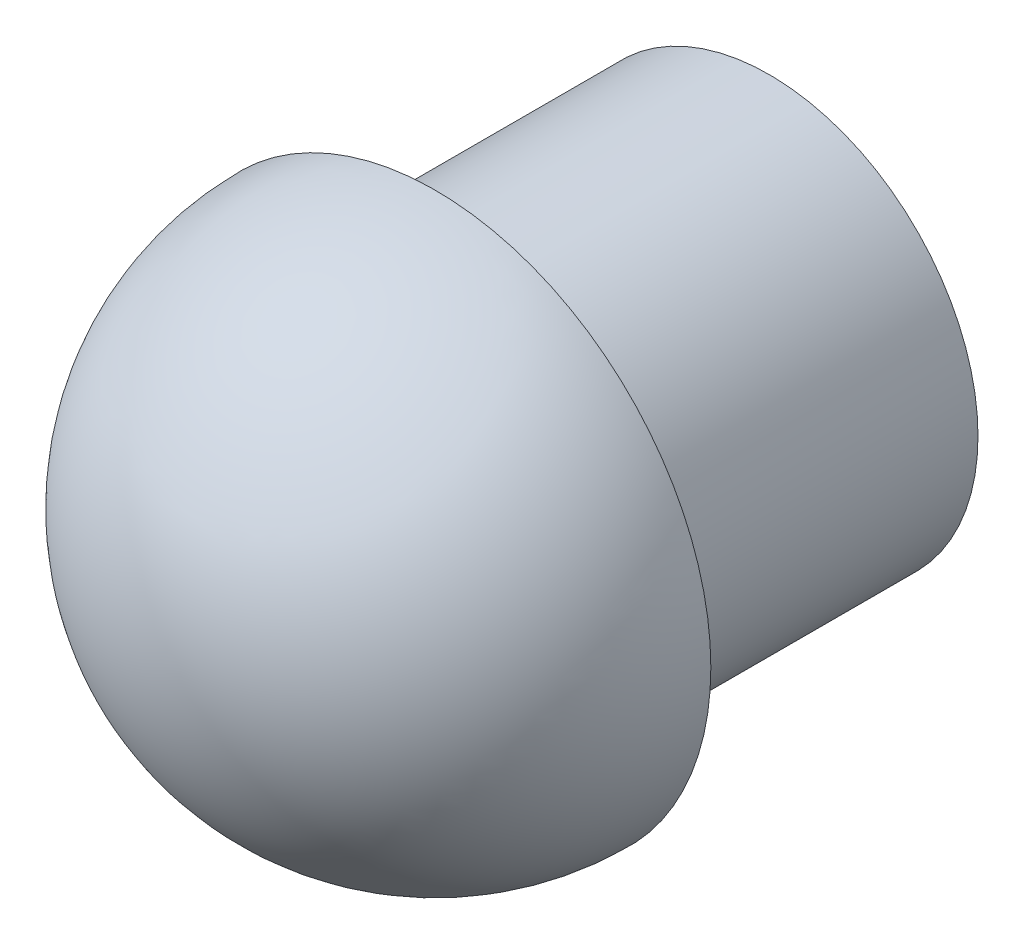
ISO-10303-21;
HEADER;
FILE_DESCRIPTION(('STEP AP214'),'2;1');
FILE_NAME('part.step','',(''),(''),'','','');
FILE_SCHEMA(('AUTOMOTIVE_DESIGN { 1 0 10303 214 1 1 1 1 }'));
ENDSEC;
DATA;
#1=APPLICATION_CONTEXT('core data for automotive mechanical design processes');
#2=APPLICATION_PROTOCOL_DEFINITION('international standard','automotive_design',2000,#1);
#3=PRODUCT_CONTEXT('',#1,'mechanical');
#4=PRODUCT('Part','Part','',(#3));
#5=PRODUCT_RELATED_PRODUCT_CATEGORY('part','',(#4));
#6=PRODUCT_DEFINITION_FORMATION('','',#4);
#7=PRODUCT_DEFINITION_CONTEXT('part definition',#1,'design');
#8=PRODUCT_DEFINITION('design','',#6,#7);
#9=PRODUCT_DEFINITION_SHAPE('','',#8);
#10=(LENGTH_UNIT() NAMED_UNIT(*) SI_UNIT(.MILLI.,.METRE.));
#11=(NAMED_UNIT(*) PLANE_ANGLE_UNIT() SI_UNIT($,.RADIAN.));
#12=(NAMED_UNIT(*) SI_UNIT($,.STERADIAN.) SOLID_ANGLE_UNIT());
#13=UNCERTAINTY_MEASURE_WITH_UNIT(LENGTH_MEASURE(1.E-05),#10,'distance_accuracy_value','');
#14=(GEOMETRIC_REPRESENTATION_CONTEXT(3) GLOBAL_UNCERTAINTY_ASSIGNED_CONTEXT((#13)) GLOBAL_UNIT_ASSIGNED_CONTEXT((#10,
#11,#12)) REPRESENTATION_CONTEXT('',''));
#15=CARTESIAN_POINT('',(0.,0.,0.));
#16=DIRECTION('',(0.,0.,1.));
#17=DIRECTION('',(1.,0.,0.));
#18=AXIS2_PLACEMENT_3D('',#15,#16,#17);
#19=CARTESIAN_POINT('',(0.,0.,10.));
#20=DIRECTION('',(0.,0.,-1.));
#21=DIRECTION('',(-1.,0.,0.));
#22=AXIS2_PLACEMENT_3D('',#19,#20,#21);
#23=CYLINDRICAL_SURFACE('',#22,6.25);
#24=CARTESIAN_POINT('',(0.,0.,10.));
#25=DIRECTION('',(0.,0.,1.));
#26=DIRECTION('',(1.,0.,0.));
#27=AXIS2_PLACEMENT_3D('',#24,#25,#26);
#28=CIRCLE('',#27,6.25);
#29=CARTESIAN_POINT('',(6.25,0.,10.));
#30=VERTEX_POINT('',#29);
#31=EDGE_CURVE('E10',#30,#30,#28,.T.);
#32=ORIENTED_EDGE('',*,*,#31,.F.);
#33=EDGE_LOOP('',(#32));
#34=FACE_BOUND('',#33,.T.);
#35=CARTESIAN_POINT('',(0.,0.,0.));
#36=DIRECTION('',(0.,0.,1.));
#37=DIRECTION('',(1.,0.,0.));
#38=AXIS2_PLACEMENT_3D('',#35,#36,#37);
#39=CIRCLE('',#38,6.25);
#40=CARTESIAN_POINT('',(6.25,0.,0.));
#41=VERTEX_POINT('',#40);
#42=EDGE_CURVE('E38',#41,#41,#39,.T.);
#43=ORIENTED_EDGE('',*,*,#42,.T.);
#44=EDGE_LOOP('',(#43));
#45=FACE_BOUND('',#44,.T.);
#46=ADVANCED_FACE('F34',(#34,#45),#23,.T.);
#47=CARTESIAN_POINT('',(0.,0.,0.));
#48=DIRECTION('',(0.,0.,1.));
#49=DIRECTION('',(1.,0.,0.));
#50=AXIS2_PLACEMENT_3D('',#47,#48,#49);
#51=PLANE('',#50);
#52=ORIENTED_EDGE('',*,*,#42,.F.);
#53=EDGE_LOOP('',(#52));
#54=FACE_BOUND('',#53,.T.);
#55=ADVANCED_FACE('F53',(#54),#51,.F.);
#56=CARTESIAN_POINT('',(0.,0.,10.));
#57=DIRECTION('',(0.,0.,1.));
#58=DIRECTION('',(1.,0.,0.));
#59=AXIS2_PLACEMENT_3D('',#56,#57,#58);
#60=PLANE('',#59);
#61=ORIENTED_EDGE('',*,*,#31,.T.);
#62=EDGE_LOOP('',(#61));
#63=FACE_BOUND('',#62,.T.);
#64=CARTESIAN_POINT('',(0.,0.,10.));
#65=DIRECTION('',(0.,0.,1.));
#66=DIRECTION('',(1.,0.,0.));
#67=AXIS2_PLACEMENT_3D('',#64,#65,#66);
#68=CIRCLE('',#67,8.25);
#69=CARTESIAN_POINT('',(8.25,0.,10.));
#70=VERTEX_POINT('',#69);
#71=EDGE_CURVE('E45',#70,#70,#68,.T.);
#72=ORIENTED_EDGE('',*,*,#71,.F.);
#73=EDGE_LOOP('',(#72));
#74=FACE_BOUND('',#73,.T.);
#75=ADVANCED_FACE('F51',(#63,#74),#60,.F.);
#76=CARTESIAN_POINT('',(0.,0.,10.));
#77=DIRECTION('',(0.,0.,1.));
#78=DIRECTION('',(1.,0.,0.));
#79=AXIS2_PLACEMENT_3D('',#76,#77,#78);
#80=SPHERICAL_SURFACE('',#79,8.25);
#81=ORIENTED_EDGE('',*,*,#71,.T.);
#82=EDGE_LOOP('',(#81));
#83=FACE_BOUND('',#82,.T.);
#84=ADVANCED_FACE('F36',(#83),#80,.T.);
#85=CLOSED_SHELL('',(#46,#55,#75,#84));
#86=MANIFOLD_SOLID_BREP('B2',#85);
#87=ADVANCED_BREP_SHAPE_REPRESENTATION('',(#18,#86),#14);
#88=SHAPE_DEFINITION_REPRESENTATION(#9,#87);
ENDSEC;
END-ISO-10303-21;
